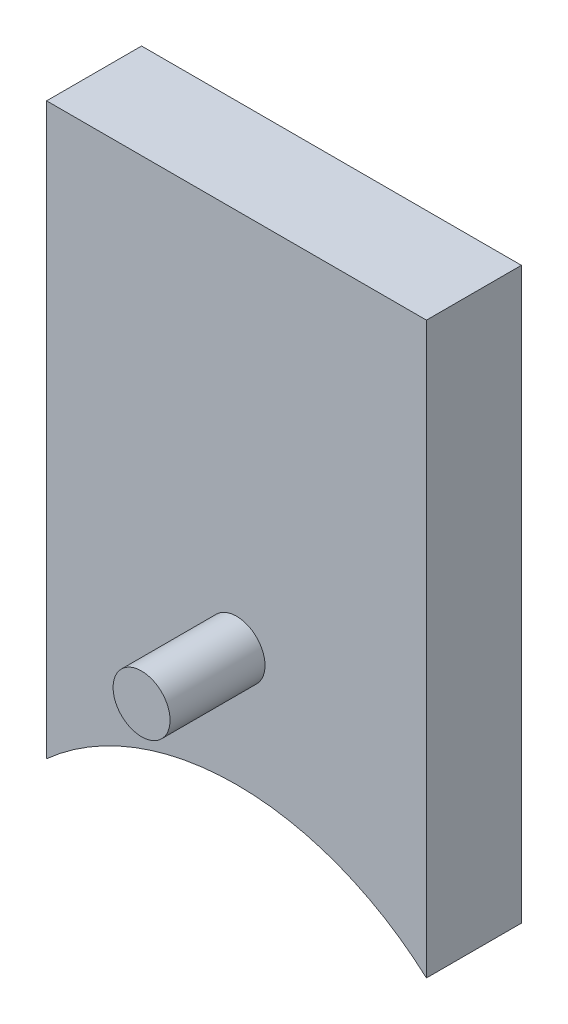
ISO-10303-21;
HEADER;
FILE_DESCRIPTION(('STEP AP214'),'2;1');
FILE_NAME('part.step','',(''),(''),'','','');
FILE_SCHEMA(('AUTOMOTIVE_DESIGN { 1 0 10303 214 1 1 1 1 }'));
ENDSEC;
DATA;
#1=APPLICATION_CONTEXT('core data for automotive mechanical design processes');
#2=APPLICATION_PROTOCOL_DEFINITION('international standard','automotive_design',2000,#1);
#3=PRODUCT_CONTEXT('',#1,'mechanical');
#4=PRODUCT('Part','Part','',(#3));
#5=PRODUCT_RELATED_PRODUCT_CATEGORY('part','',(#4));
#6=PRODUCT_DEFINITION_FORMATION('','',#4);
#7=PRODUCT_DEFINITION_CONTEXT('part definition',#1,'design');
#8=PRODUCT_DEFINITION('design','',#6,#7);
#9=PRODUCT_DEFINITION_SHAPE('','',#8);
#10=(LENGTH_UNIT() NAMED_UNIT(*) SI_UNIT(.MILLI.,.METRE.));
#11=(NAMED_UNIT(*) PLANE_ANGLE_UNIT() SI_UNIT($,.RADIAN.));
#12=(NAMED_UNIT(*) SI_UNIT($,.STERADIAN.) SOLID_ANGLE_UNIT());
#13=UNCERTAINTY_MEASURE_WITH_UNIT(LENGTH_MEASURE(1.E-05),#10,'distance_accuracy_value','');
#14=(GEOMETRIC_REPRESENTATION_CONTEXT(3) GLOBAL_UNCERTAINTY_ASSIGNED_CONTEXT((#13)) GLOBAL_UNIT_ASSIGNED_CONTEXT((#10,
#11,#12)) REPRESENTATION_CONTEXT('',''));
#15=CARTESIAN_POINT('',(0.,0.,0.));
#16=DIRECTION('',(0.,0.,1.));
#17=DIRECTION('',(1.,0.,0.));
#18=AXIS2_PLACEMENT_3D('',#15,#16,#17);
#19=CARTESIAN_POINT('',(0.,-20.,5.));
#20=DIRECTION('',(0.,0.,-1.));
#21=DIRECTION('',(-1.,0.,0.));
#22=AXIS2_PLACEMENT_3D('',#19,#20,#21);
#23=CYLINDRICAL_SURFACE('',#22,1.5);
#24=CARTESIAN_POINT('',(0.,-20.,5.));
#25=DIRECTION('',(0.,0.,1.));
#26=DIRECTION('',(1.,0.,0.));
#27=AXIS2_PLACEMENT_3D('',#24,#25,#26);
#28=CIRCLE('',#27,1.5);
#29=CARTESIAN_POINT('',(1.5,-20.,5.));
#30=VERTEX_POINT('',#29);
#31=EDGE_CURVE('E11',#30,#30,#28,.T.);
#32=ORIENTED_EDGE('',*,*,#31,.F.);
#33=EDGE_LOOP('',(#32));
#34=FACE_BOUND('',#33,.T.);
#35=CARTESIAN_POINT('',(0.,-20.,0.));
#36=DIRECTION('',(0.,0.,1.));
#37=DIRECTION('',(1.,0.,0.));
#38=AXIS2_PLACEMENT_3D('',#35,#36,#37);
#39=CIRCLE('',#38,1.5);
#40=CARTESIAN_POINT('',(1.5,-20.,0.));
#41=VERTEX_POINT('',#40);
#42=EDGE_CURVE('E45',#41,#41,#39,.T.);
#43=ORIENTED_EDGE('',*,*,#42,.T.);
#44=EDGE_LOOP('',(#43));
#45=FACE_BOUND('',#44,.T.);
#46=ADVANCED_FACE('F42',(#34,#45),#23,.T.);
#47=CARTESIAN_POINT('',(0.,0.,5.));
#48=DIRECTION('',(0.,0.,1.));
#49=DIRECTION('',(1.,0.,0.));
#50=AXIS2_PLACEMENT_3D('',#47,#48,#49);
#51=PLANE('',#50);
#52=ORIENTED_EDGE('',*,*,#31,.T.);
#53=EDGE_LOOP('',(#52));
#54=FACE_BOUND('',#53,.T.);
#55=ADVANCED_FACE('F57',(#54),#51,.T.);
#56=CARTESIAN_POINT('',(0.,0.,0.));
#57=DIRECTION('',(0.,0.,1.));
#58=DIRECTION('',(1.,0.,0.));
#59=AXIS2_PLACEMENT_3D('',#56,#57,#58);
#60=PLANE('',#59);
#61=ORIENTED_EDGE('',*,*,#42,.F.);
#62=EDGE_LOOP('',(#61));
#63=FACE_BOUND('',#62,.T.);
#64=ADVANCED_FACE('F55',(#63),#60,.F.);
#65=CLOSED_SHELL('',(#46,#55,#64));
#66=MANIFOLD_SOLID_BREP('B2',#65);
#67=CARTESIAN_POINT('',(-10.,0.,-5.));
#68=DIRECTION('',(-1.,0.,0.));
#69=DIRECTION('',(0.,-1.,0.));
#70=AXIS2_PLACEMENT_3D('',#67,#68,#69);
#71=PLANE('',#70);
#72=DIRECTION('',(0.,-1.,0.));
#73=VECTOR('',#72,1.);
#74=CARTESIAN_POINT('',(-10.,0.,0.));
#75=LINE('',#74,#73);
#76=CARTESIAN_POINT('',(-10.,0.,0.));
#77=VERTEX_POINT('',#76);
#78=CARTESIAN_POINT('',(-9.99999999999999,-30.,0.));
#79=VERTEX_POINT('',#78);
#80=EDGE_CURVE('E147',#77,#79,#75,.T.);
#81=ORIENTED_EDGE('',*,*,#80,.F.);
#82=DIRECTION('',(0.,0.,1.));
#83=VECTOR('',#82,1.);
#84=CARTESIAN_POINT('',(-10.,0.,-5.));
#85=LINE('',#84,#83);
#86=CARTESIAN_POINT('',(-10.,0.,-5.));
#87=VERTEX_POINT('',#86);
#88=EDGE_CURVE('E40',#87,#77,#85,.T.);
#89=ORIENTED_EDGE('',*,*,#88,.F.);
#90=DIRECTION('',(0.,-1.,0.));
#91=VECTOR('',#90,1.);
#92=CARTESIAN_POINT('',(-10.,0.,-5.));
#93=LINE('',#92,#91);
#94=CARTESIAN_POINT('',(-9.99999999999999,-30.,-5.));
#95=VERTEX_POINT('',#94);
#96=EDGE_CURVE('E140',#87,#95,#93,.T.);
#97=ORIENTED_EDGE('',*,*,#96,.T.);
#98=DIRECTION('',(0.,0.,1.));
#99=VECTOR('',#98,1.);
#100=CARTESIAN_POINT('',(-9.99999999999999,-30.,-5.));
#101=LINE('',#100,#99);
#102=EDGE_CURVE('E85',#95,#79,#101,.T.);
#103=ORIENTED_EDGE('',*,*,#102,.T.);
#104=EDGE_LOOP('',(#81,#89,#97,#103));
#105=FACE_BOUND('',#104,.T.);
#106=ADVANCED_FACE('F82',(#105),#71,.T.);
#107=CARTESIAN_POINT('',(-10.,0.,-5.));
#108=DIRECTION('',(0.,1.,0.));
#109=DIRECTION('',(-1.,0.,0.));
#110=AXIS2_PLACEMENT_3D('',#107,#108,#109);
#111=PLANE('',#110);
#112=DIRECTION('',(-1.,0.,0.));
#113=VECTOR('',#112,1.);
#114=CARTESIAN_POINT('',(-10.,0.,0.));
#115=LINE('',#114,#113);
#116=CARTESIAN_POINT('',(10.,0.,0.));
#117=VERTEX_POINT('',#116);
#118=EDGE_CURVE('E142',#117,#77,#115,.T.);
#119=ORIENTED_EDGE('',*,*,#118,.F.);
#120=DIRECTION('',(0.,0.,1.));
#121=VECTOR('',#120,1.);
#122=CARTESIAN_POINT('',(10.,0.,-5.));
#123=LINE('',#122,#121);
#124=CARTESIAN_POINT('',(10.,0.,-5.));
#125=VERTEX_POINT('',#124);
#126=EDGE_CURVE('E91',#125,#117,#123,.T.);
#127=ORIENTED_EDGE('',*,*,#126,.F.);
#128=DIRECTION('',(-1.,0.,0.));
#129=VECTOR('',#128,1.);
#130=CARTESIAN_POINT('',(-10.,0.,-5.));
#131=LINE('',#130,#129);
#132=EDGE_CURVE('E137',#125,#87,#131,.T.);
#133=ORIENTED_EDGE('',*,*,#132,.T.);
#134=ORIENTED_EDGE('',*,*,#88,.T.);
#135=EDGE_LOOP('',(#119,#127,#133,#134));
#136=FACE_BOUND('',#135,.T.);
#137=ADVANCED_FACE('F158',(#136),#111,.T.);
#138=CARTESIAN_POINT('',(10.,0.,-5.));
#139=DIRECTION('',(1.,0.,0.));
#140=DIRECTION('',(0.,1.,0.));
#141=AXIS2_PLACEMENT_3D('',#138,#139,#140);
#142=PLANE('',#141);
#143=DIRECTION('',(0.,1.,0.));
#144=VECTOR('',#143,1.);
#145=CARTESIAN_POINT('',(10.,0.,0.));
#146=LINE('',#145,#144);
#147=CARTESIAN_POINT('',(10.,-30.,0.));
#148=VERTEX_POINT('',#147);
#149=EDGE_CURVE('E132',#148,#117,#146,.T.);
#150=ORIENTED_EDGE('',*,*,#149,.F.);
#151=DIRECTION('',(0.,0.,1.));
#152=VECTOR('',#151,1.);
#153=CARTESIAN_POINT('',(10.,-30.,-5.));
#154=LINE('',#153,#152);
#155=CARTESIAN_POINT('',(10.,-30.,-5.));
#156=VERTEX_POINT('',#155);
#157=EDGE_CURVE('E127',#156,#148,#154,.T.);
#158=ORIENTED_EDGE('',*,*,#157,.F.);
#159=DIRECTION('',(0.,1.,0.));
#160=VECTOR('',#159,1.);
#161=CARTESIAN_POINT('',(10.,0.,-5.));
#162=LINE('',#161,#160);
#163=EDGE_CURVE('E130',#156,#125,#162,.T.);
#164=ORIENTED_EDGE('',*,*,#163,.T.);
#165=ORIENTED_EDGE('',*,*,#126,.T.);
#166=EDGE_LOOP('',(#150,#158,#164,#165));
#167=FACE_BOUND('',#166,.T.);
#168=ADVANCED_FACE('F129',(#167),#142,.T.);
#169=CARTESIAN_POINT('',(0.,-41.1803398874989,-5.));
#170=DIRECTION('',(0.,0.,1.));
#171=DIRECTION('',(1.,0.,0.));
#172=AXIS2_PLACEMENT_3D('',#169,#170,#171);
#173=CYLINDRICAL_SURFACE('',#172,15.);
#174=CARTESIAN_POINT('',(0.,-41.1803398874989,0.));
#175=DIRECTION('',(0.,0.,-1.));
#176=DIRECTION('',(-1.,0.,0.));
#177=AXIS2_PLACEMENT_3D('',#174,#175,#176);
#178=CIRCLE('',#177,15.);
#179=EDGE_CURVE('E150',#79,#148,#178,.T.);
#180=ORIENTED_EDGE('',*,*,#179,.F.);
#181=ORIENTED_EDGE('',*,*,#102,.F.);
#182=CARTESIAN_POINT('',(0.,-41.1803398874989,-5.));
#183=DIRECTION('',(0.,0.,-1.));
#184=DIRECTION('',(-1.,0.,0.));
#185=AXIS2_PLACEMENT_3D('',#182,#183,#184);
#186=CIRCLE('',#185,15.);
#187=EDGE_CURVE('E136',#95,#156,#186,.T.);
#188=ORIENTED_EDGE('',*,*,#187,.T.);
#189=ORIENTED_EDGE('',*,*,#157,.T.);
#190=EDGE_LOOP('',(#180,#181,#188,#189));
#191=FACE_BOUND('',#190,.T.);
#192=ADVANCED_FACE('F139',(#191),#173,.F.);
#193=CARTESIAN_POINT('',(0.,-41.1803398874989,-5.));
#194=DIRECTION('',(0.,0.,-1.));
#195=DIRECTION('',(-1.,0.,0.));
#196=AXIS2_PLACEMENT_3D('',#193,#194,#195);
#197=PLANE('',#196);
#198=CARTESIAN_POINT('',(0.,-20.,-5.));
#199=DIRECTION('',(0.,0.,1.));
#200=DIRECTION('',(1.,0.,0.));
#201=AXIS2_PLACEMENT_3D('',#198,#199,#200);
#202=CIRCLE('',#201,1.5);
#203=CARTESIAN_POINT('',(1.5,-20.,-5.));
#204=VERTEX_POINT('',#203);
#205=EDGE_CURVE('E151',#204,#204,#202,.T.);
#206=ORIENTED_EDGE('',*,*,#205,.T.);
#207=EDGE_LOOP('',(#206));
#208=FACE_BOUND('',#207,.T.);
#209=ORIENTED_EDGE('',*,*,#96,.F.);
#210=ORIENTED_EDGE('',*,*,#132,.F.);
#211=ORIENTED_EDGE('',*,*,#163,.F.);
#212=ORIENTED_EDGE('',*,*,#187,.F.);
#213=EDGE_LOOP('',(#209,#210,#211,#212));
#214=FACE_BOUND('',#213,.T.);
#215=ADVANCED_FACE('F135',(#208,#214),#197,.T.);
#216=CARTESIAN_POINT('',(0.,-41.1803398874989,0.));
#217=DIRECTION('',(0.,0.,-1.));
#218=DIRECTION('',(-1.,0.,0.));
#219=AXIS2_PLACEMENT_3D('',#216,#217,#218);
#220=PLANE('',#219);
#221=CARTESIAN_POINT('',(0.,-20.,0.));
#222=DIRECTION('',(0.,0.,1.));
#223=DIRECTION('',(1.,0.,0.));
#224=AXIS2_PLACEMENT_3D('',#221,#222,#223);
#225=CIRCLE('',#224,1.5);
#226=CARTESIAN_POINT('',(1.5,-20.,0.));
#227=VERTEX_POINT('',#226);
#228=EDGE_CURVE('E188',#227,#227,#225,.T.);
#229=ORIENTED_EDGE('',*,*,#228,.F.);
#230=EDGE_LOOP('',(#229));
#231=FACE_BOUND('',#230,.T.);
#232=ORIENTED_EDGE('',*,*,#80,.T.);
#233=ORIENTED_EDGE('',*,*,#179,.T.);
#234=ORIENTED_EDGE('',*,*,#149,.T.);
#235=ORIENTED_EDGE('',*,*,#118,.T.);
#236=EDGE_LOOP('',(#232,#233,#234,#235));
#237=FACE_BOUND('',#236,.T.);
#238=ADVANCED_FACE('F157',(#231,#237),#220,.F.);
#239=CARTESIAN_POINT('',(0.,-20.,-5.));
#240=DIRECTION('',(0.,0.,1.));
#241=DIRECTION('',(1.,0.,0.));
#242=AXIS2_PLACEMENT_3D('',#239,#240,#241);
#243=CYLINDRICAL_SURFACE('',#242,1.5);
#244=ORIENTED_EDGE('',*,*,#205,.F.);
#245=EDGE_LOOP('',(#244));
#246=FACE_BOUND('',#245,.T.);
#247=ORIENTED_EDGE('',*,*,#228,.T.);
#248=EDGE_LOOP('',(#247));
#249=FACE_BOUND('',#248,.T.);
#250=ADVANCED_FACE('F176',(#246,#249),#243,.F.);
#251=CLOSED_SHELL('',(#106,#137,#168,#192,#215,#238,#250));
#252=MANIFOLD_SOLID_BREP('B6',#251);
#253=ADVANCED_BREP_SHAPE_REPRESENTATION('',(#18,#66,#252),#14);
#254=SHAPE_DEFINITION_REPRESENTATION(#9,#253);
ENDSEC;
END-ISO-10303-21;
